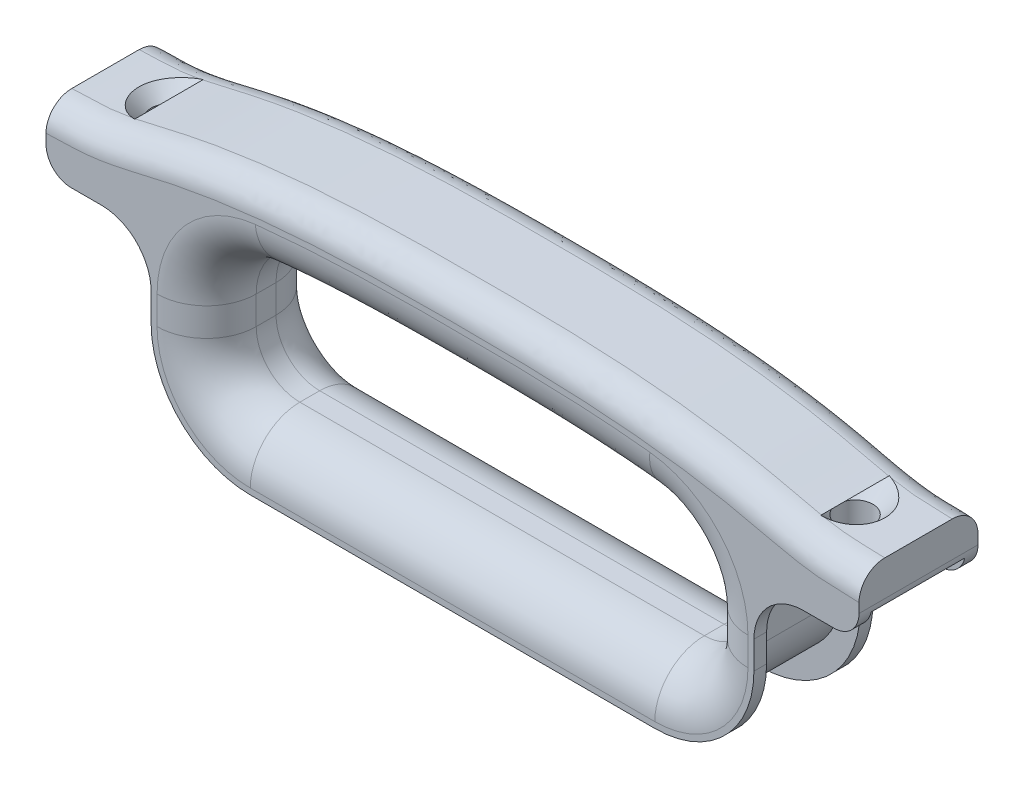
from build123d import *

# Parameters (mm, degrees)
EXTRUDE1_DEPTH                                 = 15
FILLET1_R                                      = 6.5
CUT_EXTRUDE1_DEPTH                             = 125.885197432
CUT_EXTRUDE1_DEPTH_BACK                        = 125.885197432
FILLET2_R                                      = 12.5
CUT_EXTRUDE2_DEPTH                             = 11.8
CUT_EXTRUDE2_DEPTH_BACK                        = 11.8
CSK_FOR_M8_FLAT_HEAD_MACHINE_SCREW1_AT_2_COUNT = 2
CSK_FOR_M8_FLAT_HEAD_MACHINE_SCREW1_AT_2_PITCH = 173


with BuildPart() as part:
    # Sketch1 → Extrude1 (new, symmetric)
    with BuildSketch(Plane.XY):
        with BuildLine():
            Line((-102.5, 59.75), (-102.5, 50.85))
            ThreePointArc((-102.5, 50.85), (-100.640128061, 46.359871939), (-96.15, 44.5))
            Line((-96.15, 44.5), (-88.5, 44.5))
            ThreePointArc((-88.5, 44.5), (-79.661165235, 40.838834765), (-76, 32))
            Line((-76, 32), (-76, 25))
            ThreePointArc((-76, 25), (-68.67766953, 7.32233047), (-51, 0))
            Line((-51, 0), (51, 0))
            ThreePointArc((51, 0), (68.67766953, 7.32233047), (76, 25))
            Line((76, 25), (76, 32))
            ThreePointArc((76, 32), (79.661165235, 40.838834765), (88.5, 44.5))
            Line((88.5, 44.5), (96.15, 44.5))
            ThreePointArc((96.15, 44.5), (100.640128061, 46.359871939), (102.5, 50.85))
            Line((102.5, 50.85), (102.5, 59.75))
            add(Edge.make_bspline(
                [(-102.5, 59.75), (-100.027786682, 59.966290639), (-90.993778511, 59.641031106), (-57.596767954, 68.982079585), (-3.4e-06, 70.362694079), (57.596776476, 68.982078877), (90.993773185, 59.64103157), (100.027791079, 59.966290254), (102.5, 59.75)],
                knots=[0, 0, 0, 0, 0.036399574, 0.130111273, 0.5, 0.869888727, 0.963600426, 1, 1, 1, 1], degree=3))
        make_face()
    extrude(amount=EXTRUDE1_DEPTH, both=True)

    # Fillet1
    fillet1_edges = [part.edges().sort_by_distance(p)[0] for p in [
        (0, 69.75, -15),
        (0, 69.75, 15),
    ]]
    fillet(fillet1_edges, radius=FILLET1_R)

    # Sketch2 → Cut-Extrude1 (cut, two sides: drawn at the far end of the back side and taken through both)
    with BuildSketch(Plane.XY.offset(-CUT_EXTRUDE1_DEPTH_BACK)):
        with BuildLine():
            Line((-62, 32.118658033), (-62, 25))
            ThreePointArc((-62, 25), (-58.778174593, 17.221825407), (-51, 14))
            Line((-51, 14), (51, 14))
            ThreePointArc((51, 14), (58.778174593, 17.221825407), (62, 25))
            Line((62, 25), (62, 32.118660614))
            ThreePointArc((62, 32.118660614), (58.101929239, 42.301793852), (48.400498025, 47.279081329))
            add(Edge.make_bspline(
                [(48.400498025, 47.279081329), (43.236460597, 47.841284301), (38.053440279, 48.24393418), (27.412901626, 48.835525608), (21.954134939, 49.013974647), (11.018804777, 49.221288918), (5.543591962, 49.249765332), (-10.870598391, 49.250465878), (-21.811191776, 49.143431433), (-35.474212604, 48.388092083), (-38.20791804, 48.205377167), (-43.429548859, 47.78283395), (-45.917970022, 47.549333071), (-48.400403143, 47.279089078)],
                knots=[0.130681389, 0.130681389, 0.130681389, 0.130681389, 0.25, 0.25, 0.375, 0.375, 0.5, 0.5, 0.75, 0.75, 0.8125, 0.8125, 0.869628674, 0.869628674, 0.869628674, 0.869628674], degree=3))
            ThreePointArc((-48.400403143, 47.279089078), (-58.101897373, 42.301826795), (-62, 32.118658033))
        make_face()
    extrude(amount=CUT_EXTRUDE1_DEPTH + CUT_EXTRUDE1_DEPTH_BACK, mode=Mode.SUBTRACT)

    # Fillet2
    fillet2_edges = [part.edges().sort_by_distance(p)[0] for p in [
        (-58.778174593, 17.221825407, -15),
        (-62, 28.559329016, -15),
        (-58.101897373, 42.301826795, -15),
        (3.6555e-05, 49.250000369, -15),
        (58.101929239, 42.301793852, -15),
        (62, 28.559330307, -15),
        (58.778174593, 17.221825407, -15),
        (-58.778174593, 17.221825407, 15),
        (-62, 28.559329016, 15),
        (-58.101897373, 42.301826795, 15),
        (3.6555e-05, 49.250000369, 15),
        (58.101929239, 42.301793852, 15),
        (62, 28.559330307, 15),
        (58.778174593, 17.221825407, 15),
        (0, 14, -15),
        (0, 14, 15),
    ]]
    fillet(fillet2_edges, radius=FILLET2_R)

    # Sketch3 → Cut-Extrude2 (cut, two sides: drawn at the far end of the back side and taken through both)
    with BuildSketch(Plane.XY.offset(-CUT_EXTRUDE2_DEPTH_BACK)):
        with BuildLine():
            Line((-108.356799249, 49.5), (-108.356799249, -10.025388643))
            Line((-108.356799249, -10.025388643), (109.318901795, -10.025388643))
            Line((109.318901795, -10.025388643), (109.318901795, 49.5))
            Line((109.318901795, 49.5), (88.5, 49.5))
            ThreePointArc((88.5, 49.5), (76.125631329, 44.374368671), (71, 32))
            Line((71, 32), (71, 25))
            add(Edge.make_bspline(
                [(51, 6.35), (62.078218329, 6.35), (71, 15.884552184), (71, 25)],
                knots=[0, 0, 0, 0, 1, 1, 1, 1], degree=3))
            Line((51, 6.35), (-51, 6.35))
            add(Edge.make_bspline(
                [(-71, 25), (-71, 14.203056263), (-60.115447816, 6.35), (-51, 6.35)],
                knots=[0, 0, 0, 0, 1, 1, 1, 1], degree=3))
            Line((-71, 25), (-71, 32))
            ThreePointArc((-71, 32), (-76.125631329, 44.374368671), (-88.5, 49.5))
            Line((-88.5, 49.5), (-108.356799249, 49.5))
        make_face()
    extrude(amount=CUT_EXTRUDE2_DEPTH + CUT_EXTRUDE2_DEPTH_BACK, mode=Mode.SUBTRACT)

    # Sketch7 → CSK for M8 Flat Head Machine Screw1 (revolve, cut)
    with BuildSketch(Plane(origin=(86.5, 61.121999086, 0), x_dir=(0, 0, 1), z_dir=(1, 0, 0))):
        Polygon((0, 0), (0, 61.121999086), (4.5, 61.121999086), (4.5, 4.15), (8.65, 0), align=None)
    csk_for_m8_flat_head_machine_screw1 = revolve(axis=Axis((86.5, 67.471999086, 0), (0, -1, 0)), mode=Mode.SUBTRACT)

    # CSK for M8 Flat Head Machine Screw1 at 2: CSK for M8 Flat Head Machine Screw1 ×2
    with Locations(*[(-i * CSK_FOR_M8_FLAT_HEAD_MACHINE_SCREW1_AT_2_PITCH, 0, 0) for i in range(1, CSK_FOR_M8_FLAT_HEAD_MACHINE_SCREW1_AT_2_COUNT)]):
        add(csk_for_m8_flat_head_machine_screw1, mode=Mode.SUBTRACT)


solid = part.part
